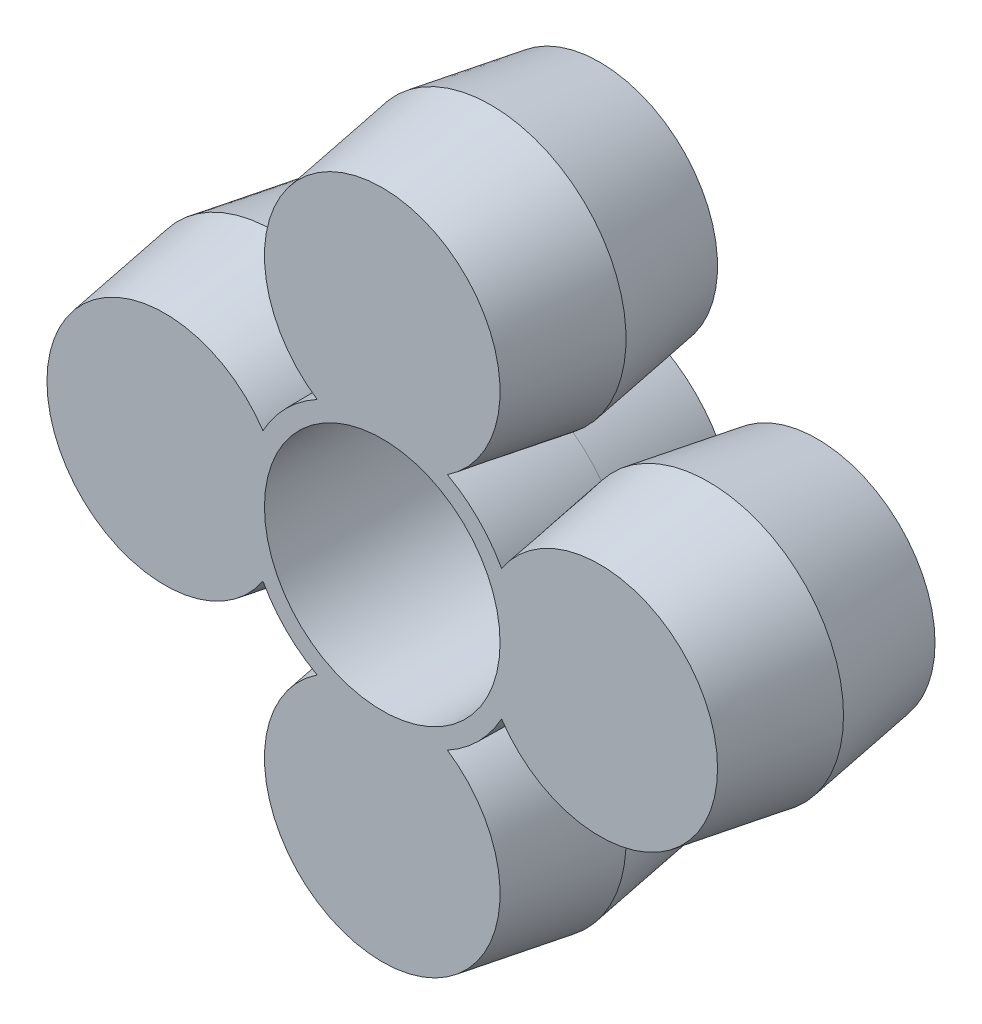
ISO-10303-21;
HEADER;
FILE_DESCRIPTION(('STEP AP214'),'2;1');
FILE_NAME('part.step','',(''),(''),'','','');
FILE_SCHEMA(('AUTOMOTIVE_DESIGN { 1 0 10303 214 1 1 1 1 }'));
ENDSEC;
DATA;
#1=APPLICATION_CONTEXT('core data for automotive mechanical design processes');
#2=APPLICATION_PROTOCOL_DEFINITION('international standard','automotive_design',2000,#1);
#3=PRODUCT_CONTEXT('',#1,'mechanical');
#4=PRODUCT('Part','Part','',(#3));
#5=PRODUCT_RELATED_PRODUCT_CATEGORY('part','',(#4));
#6=PRODUCT_DEFINITION_FORMATION('','',#4);
#7=PRODUCT_DEFINITION_CONTEXT('part definition',#1,'design');
#8=PRODUCT_DEFINITION('design','',#6,#7);
#9=PRODUCT_DEFINITION_SHAPE('','',#8);
#10=(LENGTH_UNIT() NAMED_UNIT(*) SI_UNIT(.MILLI.,.METRE.));
#11=(NAMED_UNIT(*) PLANE_ANGLE_UNIT() SI_UNIT($,.RADIAN.));
#12=(NAMED_UNIT(*) SI_UNIT($,.STERADIAN.) SOLID_ANGLE_UNIT());
#13=UNCERTAINTY_MEASURE_WITH_UNIT(LENGTH_MEASURE(1.E-05),#10,'distance_accuracy_value','');
#14=(GEOMETRIC_REPRESENTATION_CONTEXT(3) GLOBAL_UNCERTAINTY_ASSIGNED_CONTEXT((#13)) GLOBAL_UNIT_ASSIGNED_CONTEXT((#10,
#11,#12)) REPRESENTATION_CONTEXT('',''));
#15=CARTESIAN_POINT('',(0.,0.,0.));
#16=DIRECTION('',(0.,0.,1.));
#17=DIRECTION('',(1.,0.,0.));
#18=AXIS2_PLACEMENT_3D('',#15,#16,#17);
#19=CARTESIAN_POINT('',(0.,0.,-12.));
#20=DIRECTION('',(0.,0.,1.));
#21=DIRECTION('',(1.,0.,0.));
#22=AXIS2_PLACEMENT_3D('',#19,#20,#21);
#23=CONICAL_SURFACE('',#22,7.5,0.0130899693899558);
#24=CARTESIAN_POINT('',(0.,0.,-12.));
#25=DIRECTION('',(0.,0.,1.));
#26=DIRECTION('',(1.,0.,0.));
#27=AXIS2_PLACEMENT_3D('',#24,#25,#26);
#28=CIRCLE('',#27,7.5);
#29=CARTESIAN_POINT('',(3.59301018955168,6.58333333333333,-12.));
#30=VERTEX_POINT('',#29);
#31=CARTESIAN_POINT('',(6.58333333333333,3.59301018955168,-12.));
#32=VERTEX_POINT('',#31);
#33=EDGE_CURVE('E117',#30,#32,#28,.F.);
#34=ORIENTED_EDGE('',*,*,#33,.F.);
#35=CARTESIAN_POINT('',(3.59301018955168,6.58333333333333,-12.));
#36=CARTESIAN_POINT('',(3.62831831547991,6.56716735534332,-11.7917016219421));
#37=CARTESIAN_POINT('',(3.66326227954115,6.55086224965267,-11.5833522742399));
#38=CARTESIAN_POINT('',(3.79749136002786,6.48706692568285,-10.7748716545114));
#39=CARTESIAN_POINT('',(3.89426254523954,6.43856369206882,-10.1744012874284));
#40=CARTESIAN_POINT('',(4.06586710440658,6.34828377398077,-9.08205060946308));
#41=CARTESIAN_POINT('',(4.14149186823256,6.3068860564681,-8.59026246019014));
#42=CARTESIAN_POINT('',(4.28196818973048,6.22705349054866,-7.65884142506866));
#43=CARTESIAN_POINT('',(4.34710864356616,6.18877340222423,-7.21923883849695));
#44=CARTESIAN_POINT('',(4.44907497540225,6.12690243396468,-6.51972483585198));
#45=CARTESIAN_POINT('',(4.48658191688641,6.10370908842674,-6.25987733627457));
#46=CARTESIAN_POINT('',(4.52374323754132,6.08030269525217,-5.99999999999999));
#47=B_SPLINE_CURVE_WITH_KNOTS('',3,(#35,#36,#37,#38,#39,#40,#41,#42,#43,#44,#45,#46),
.UNSPECIFIED.,.F.,.F.,(4,2,2,2,2,4),(0.,0.635661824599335,2.46607723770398,3.96393102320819,
5.30206851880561,6.09275574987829),.UNSPECIFIED.);
#48=CARTESIAN_POINT('',(4.52374323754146,6.0803026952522,-6.));
#49=VERTEX_POINT('',#48);
#50=EDGE_CURVE('E122',#30,#49,#47,.T.);
#51=ORIENTED_EDGE('',*,*,#50,.T.);
#52=CARTESIAN_POINT('',(0.,0.,-6.));
#53=DIRECTION('',(0.,0.,1.));
#54=DIRECTION('',(1.,0.,0.));
#55=AXIS2_PLACEMENT_3D('',#52,#53,#54);
#56=CIRCLE('',#55,7.578544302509);
#57=CARTESIAN_POINT('',(6.0803026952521,4.52374323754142,-6.));
#58=VERTEX_POINT('',#57);
#59=EDGE_CURVE('E119',#49,#58,#56,.F.);
#60=ORIENTED_EDGE('',*,*,#59,.T.);
#61=CARTESIAN_POINT('',(6.58333333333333,3.59301018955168,-12.));
#62=CARTESIAN_POINT('',(6.5691052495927,3.62408777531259,-11.8166715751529));
#63=CARTESIAN_POINT('',(6.55476938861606,3.65488108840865,-11.6333033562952));
#64=CARTESIAN_POINT('',(6.51303889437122,3.74307048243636,-11.1034058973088));
#65=CARTESIAN_POINT('',(6.48536773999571,3.79977349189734,-10.756782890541));
#66=CARTESIAN_POINT('',(6.42925570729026,3.91145625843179,-10.0632787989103));
#67=CARTESIAN_POINT('',(6.40081473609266,3.96643580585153,-9.7163976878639));
#68=CARTESIAN_POINT('',(6.33675865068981,4.08687172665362,-8.94530159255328));
#69=CARTESIAN_POINT('',(6.30095451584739,4.15193935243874,-8.52104164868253));
#70=CARTESIAN_POINT('',(6.20469878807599,4.32128764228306,-7.39805222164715));
#71=CARTESIAN_POINT('',(6.14327156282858,4.4237358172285,-6.6991290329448));
#72=CARTESIAN_POINT('',(6.08030269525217,4.52374323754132,-5.99999999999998));
#73=B_SPLINE_CURVE_WITH_KNOTS('',3,(#61,#62,#63,#64,#65,#66,#67,#68,#69,#70,#71,#72),
.UNSPECIFIED.,.F.,.F.,(4,2,2,2,2,4),(0.,0.559462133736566,1.61641188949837,2.67348972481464,
3.96561693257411,6.09275638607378),.UNSPECIFIED.);
#74=EDGE_CURVE('E20',#32,#58,#73,.T.);
#75=ORIENTED_EDGE('',*,*,#74,.F.);
#76=EDGE_LOOP('',(#34,#51,#60,#75));
#77=FACE_BOUND('',#76,.T.);
#78=ADVANCED_FACE('F16',(#77),#23,.T.);
#79=CARTESIAN_POINT('',(0.,12.,-12.));
#80=DIRECTION('',(0.,0.,1.));
#81=DIRECTION('',(1.,0.,0.));
#82=AXIS2_PLACEMENT_3D('',#79,#80,#81);
#83=CONICAL_SURFACE('',#82,6.5,0.157079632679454);
#84=CARTESIAN_POINT('',(0.,12.,-12.));
#85=DIRECTION('',(0.,0.,1.));
#86=DIRECTION('',(1.,0.,0.));
#87=AXIS2_PLACEMENT_3D('',#84,#85,#86);
#88=CIRCLE('',#87,6.5);
#89=CARTESIAN_POINT('',(-3.59301018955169,6.58333333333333,-12.));
#90=VERTEX_POINT('',#89);
#91=EDGE_CURVE('E135',#90,#30,#88,.F.);
#92=ORIENTED_EDGE('',*,*,#91,.F.);
#93=CARTESIAN_POINT('',(-3.59301018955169,6.58333333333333,-12.));
#94=CARTESIAN_POINT('',(-3.6240877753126,6.56910524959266,-11.8166715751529));
#95=CARTESIAN_POINT('',(-3.65488108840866,6.554769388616,-11.6333033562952));
#96=CARTESIAN_POINT('',(-3.74307048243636,6.51303889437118,-11.1034058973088));
#97=CARTESIAN_POINT('',(-3.79977349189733,6.48536773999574,-10.756782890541));
#98=CARTESIAN_POINT('',(-3.91145625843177,6.42925570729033,-10.0632787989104));
#99=CARTESIAN_POINT('',(-3.96643580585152,6.40081473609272,-9.71639768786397));
#100=CARTESIAN_POINT('',(-4.08687172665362,6.33675865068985,-8.9453015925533));
#101=CARTESIAN_POINT('',(-4.15193935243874,6.30095451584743,-8.5210416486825));
#102=CARTESIAN_POINT('',(-4.32128764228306,6.20469878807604,-7.39805222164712));
#103=CARTESIAN_POINT('',(-4.4237358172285,6.14327156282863,-6.69912903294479));
#104=CARTESIAN_POINT('',(-4.52374323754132,6.08030269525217,-6.00000000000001));
#105=B_SPLINE_CURVE_WITH_KNOTS('',3,(#93,#94,#95,#96,#97,#98,#99,#100,#101,#102,#103,#104),
.UNSPECIFIED.,.F.,.F.,(4,2,2,2,2,4),(0.,0.559462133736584,1.61641188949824,2.67348972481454,
3.96561693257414,6.09275638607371),.UNSPECIFIED.);
#106=CARTESIAN_POINT('',(-4.52374323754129,6.08030269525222,-6.));
#107=VERTEX_POINT('',#106);
#108=EDGE_CURVE('E211',#90,#107,#105,.T.);
#109=ORIENTED_EDGE('',*,*,#108,.T.);
#110=CARTESIAN_POINT('',(0.,12.,-6.));
#111=DIRECTION('',(0.,0.,1.));
#112=DIRECTION('',(0.,1.,0.));
#113=AXIS2_PLACEMENT_3D('',#110,#111,#112);
#114=CIRCLE('',#113,7.450306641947);
#115=EDGE_CURVE('E339',#107,#49,#114,.F.);
#116=ORIENTED_EDGE('',*,*,#115,.T.);
#117=ORIENTED_EDGE('',*,*,#50,.F.);
#118=EDGE_LOOP('',(#92,#109,#116,#117));
#119=FACE_BOUND('',#118,.T.);
#120=ADVANCED_FACE('F207',(#119),#83,.T.);
#121=CARTESIAN_POINT('',(0.,0.,-12.));
#122=DIRECTION('',(0.,0.,1.));
#123=DIRECTION('',(1.,0.,0.));
#124=AXIS2_PLACEMENT_3D('',#121,#122,#123);
#125=CONICAL_SURFACE('',#124,7.5,0.0130899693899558);
#126=CARTESIAN_POINT('',(0.,0.,-12.));
#127=DIRECTION('',(0.,0.,1.));
#128=DIRECTION('',(1.,0.,0.));
#129=AXIS2_PLACEMENT_3D('',#126,#127,#128);
#130=CIRCLE('',#129,7.5);
#131=CARTESIAN_POINT('',(-6.58333333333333,3.59301018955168,-12.));
#132=VERTEX_POINT('',#131);
#133=EDGE_CURVE('E137',#132,#90,#130,.F.);
#134=ORIENTED_EDGE('',*,*,#133,.F.);
#135=CARTESIAN_POINT('',(-6.58333333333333,3.59301018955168,-12.));
#136=CARTESIAN_POINT('',(-6.56716735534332,3.62831831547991,-11.7917016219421));
#137=CARTESIAN_POINT('',(-6.55086224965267,3.66326227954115,-11.5833522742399));
#138=CARTESIAN_POINT('',(-6.48706692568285,3.79749136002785,-10.7748716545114));
#139=CARTESIAN_POINT('',(-6.43856369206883,3.89426254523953,-10.1744012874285));
#140=CARTESIAN_POINT('',(-6.34828377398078,4.06586710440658,-9.08205060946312));
#141=CARTESIAN_POINT('',(-6.3068860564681,4.14149186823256,-8.59026246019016));
#142=CARTESIAN_POINT('',(-6.22705349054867,4.28196818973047,-7.6588414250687));
#143=CARTESIAN_POINT('',(-6.18877340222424,4.34710864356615,-7.21923883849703));
#144=CARTESIAN_POINT('',(-6.12690243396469,4.44907497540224,-6.51972483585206));
#145=CARTESIAN_POINT('',(-6.10370908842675,4.4865819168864,-6.25987733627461));
#146=CARTESIAN_POINT('',(-6.08030269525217,4.52374323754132,-5.99999999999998));
#147=B_SPLINE_CURVE_WITH_KNOTS('',3,(#135,#136,#137,#138,#139,#140,#141,#142,#143,#144,#145,
#146),.UNSPECIFIED.,.F.,.F.,(4,2,2,2,2,4),(0.,0.635661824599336,2.46607723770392,
3.9639310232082,5.30206851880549,6.0927557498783),.UNSPECIFIED.);
#148=CARTESIAN_POINT('',(-6.08030269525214,4.52374323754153,-6.));
#149=VERTEX_POINT('',#148);
#150=EDGE_CURVE('E192',#132,#149,#147,.T.);
#151=ORIENTED_EDGE('',*,*,#150,.T.);
#152=CARTESIAN_POINT('',(0.,0.,-6.));
#153=DIRECTION('',(0.,0.,1.));
#154=DIRECTION('',(1.,0.,0.));
#155=AXIS2_PLACEMENT_3D('',#152,#153,#154);
#156=CIRCLE('',#155,7.578544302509);
#157=EDGE_CURVE('E334',#149,#107,#156,.F.);
#158=ORIENTED_EDGE('',*,*,#157,.T.);
#159=ORIENTED_EDGE('',*,*,#108,.F.);
#160=EDGE_LOOP('',(#134,#151,#158,#159));
#161=FACE_BOUND('',#160,.T.);
#162=ADVANCED_FACE('F201',(#161),#125,.T.);
#163=CARTESIAN_POINT('',(-12.,0.,-12.));
#164=DIRECTION('',(0.,0.,1.));
#165=DIRECTION('',(1.,0.,0.));
#166=AXIS2_PLACEMENT_3D('',#163,#164,#165);
#167=CONICAL_SURFACE('',#166,6.5,0.157079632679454);
#168=CARTESIAN_POINT('',(-12.,0.,-12.));
#169=DIRECTION('',(0.,0.,1.));
#170=DIRECTION('',(1.,0.,0.));
#171=AXIS2_PLACEMENT_3D('',#168,#169,#170);
#172=CIRCLE('',#171,6.5);
#173=CARTESIAN_POINT('',(-6.58333333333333,-3.59301018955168,-12.));
#174=VERTEX_POINT('',#173);
#175=EDGE_CURVE('E142',#174,#132,#172,.F.);
#176=ORIENTED_EDGE('',*,*,#175,.F.);
#177=CARTESIAN_POINT('',(-6.58333333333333,-3.59301018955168,-12.));
#178=CARTESIAN_POINT('',(-6.56910524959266,-3.62408777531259,-11.8166715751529));
#179=CARTESIAN_POINT('',(-6.554769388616,-3.65488108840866,-11.6333033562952));
#180=CARTESIAN_POINT('',(-6.51303889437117,-3.74307048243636,-11.1034058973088));
#181=CARTESIAN_POINT('',(-6.48536773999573,-3.79977349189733,-10.756782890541));
#182=CARTESIAN_POINT('',(-6.42925570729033,-3.91145625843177,-10.0632787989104));
#183=CARTESIAN_POINT('',(-6.40081473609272,-3.96643580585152,-9.71639768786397));
#184=CARTESIAN_POINT('',(-6.33675865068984,-4.08687172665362,-8.94530159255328));
#185=CARTESIAN_POINT('',(-6.30095451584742,-4.15193935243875,-8.52104164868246));
#186=CARTESIAN_POINT('',(-6.20469878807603,-4.32128764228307,-7.39805222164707));
#187=CARTESIAN_POINT('',(-6.14327156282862,-4.4237358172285,-6.69912903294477));
#188=CARTESIAN_POINT('',(-6.08030269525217,-4.52374323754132,-6.00000000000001));
#189=B_SPLINE_CURVE_WITH_KNOTS('',3,(#177,#178,#179,#180,#181,#182,#183,#184,#185,#186,#187,
#188),.UNSPECIFIED.,.F.,.F.,(4,2,2,2,2,4),(0.,0.559462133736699,1.61641188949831,
2.67348972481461,3.96561693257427,6.09275638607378),.UNSPECIFIED.);
#190=CARTESIAN_POINT('',(-6.08030269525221,-4.5237432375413,-6.));
#191=VERTEX_POINT('',#190);
#192=EDGE_CURVE('E186',#174,#191,#189,.T.);
#193=ORIENTED_EDGE('',*,*,#192,.T.);
#194=CARTESIAN_POINT('',(-12.,0.,-6.));
#195=DIRECTION('',(0.,0.,1.));
#196=DIRECTION('',(-1.,0.,0.));
#197=AXIS2_PLACEMENT_3D('',#194,#195,#196);
#198=CIRCLE('',#197,7.450306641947);
#199=EDGE_CURVE('E452',#191,#149,#198,.F.);
#200=ORIENTED_EDGE('',*,*,#199,.T.);
#201=ORIENTED_EDGE('',*,*,#150,.F.);
#202=EDGE_LOOP('',(#176,#193,#200,#201));
#203=FACE_BOUND('',#202,.T.);
#204=ADVANCED_FACE('F198',(#203),#167,.T.);
#205=CARTESIAN_POINT('',(0.,0.,-12.));
#206=DIRECTION('',(0.,0.,1.));
#207=DIRECTION('',(1.,0.,0.));
#208=AXIS2_PLACEMENT_3D('',#205,#206,#207);
#209=CONICAL_SURFACE('',#208,7.5,0.0130899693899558);
#210=CARTESIAN_POINT('',(0.,0.,-12.));
#211=DIRECTION('',(0.,0.,1.));
#212=DIRECTION('',(1.,0.,0.));
#213=AXIS2_PLACEMENT_3D('',#210,#211,#212);
#214=CIRCLE('',#213,7.5);
#215=CARTESIAN_POINT('',(-3.59301018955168,-6.58333333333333,-12.));
#216=VERTEX_POINT('',#215);
#217=EDGE_CURVE('E145',#216,#174,#214,.F.);
#218=ORIENTED_EDGE('',*,*,#217,.F.);
#219=CARTESIAN_POINT('',(-3.59301018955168,-6.58333333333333,-12.));
#220=CARTESIAN_POINT('',(-3.62831831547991,-6.56716735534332,-11.791701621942));
#221=CARTESIAN_POINT('',(-3.66326227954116,-6.55086224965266,-11.5833522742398));
#222=CARTESIAN_POINT('',(-3.79749136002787,-6.48706692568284,-10.7748716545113));
#223=CARTESIAN_POINT('',(-3.89426254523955,-6.43856369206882,-10.1744012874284));
#224=CARTESIAN_POINT('',(-4.06586710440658,-6.34828377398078,-9.08205060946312));
#225=CARTESIAN_POINT('',(-4.14149186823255,-6.30688605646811,-8.59026246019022));
#226=CARTESIAN_POINT('',(-4.28196818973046,-6.22705349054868,-7.65884142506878));
#227=CARTESIAN_POINT('',(-4.34710864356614,-6.18877340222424,-7.21923883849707));
#228=CARTESIAN_POINT('',(-4.44907497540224,-6.12690243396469,-6.51972483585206));
#229=CARTESIAN_POINT('',(-4.4865819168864,-6.10370908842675,-6.25987733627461));
#230=CARTESIAN_POINT('',(-4.52374323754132,-6.08030269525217,-5.99999999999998));
#231=B_SPLINE_CURVE_WITH_KNOTS('',3,(#219,#220,#221,#222,#223,#224,#225,#226,#227,#228,#229,
#230),.UNSPECIFIED.,.F.,.F.,(4,2,2,2,2,4),(0.,0.635661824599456,2.46607723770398,
3.96393102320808,5.30206851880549,6.0927557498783),.UNSPECIFIED.);
#232=CARTESIAN_POINT('',(-4.52374323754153,-6.08030269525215,-6.));
#233=VERTEX_POINT('',#232);
#234=EDGE_CURVE('E180',#216,#233,#231,.T.);
#235=ORIENTED_EDGE('',*,*,#234,.T.);
#236=CARTESIAN_POINT('',(0.,0.,-6.));
#237=DIRECTION('',(0.,0.,1.));
#238=DIRECTION('',(1.,0.,0.));
#239=AXIS2_PLACEMENT_3D('',#236,#237,#238);
#240=CIRCLE('',#239,7.578544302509);
#241=EDGE_CURVE('E308',#233,#191,#240,.F.);
#242=ORIENTED_EDGE('',*,*,#241,.T.);
#243=ORIENTED_EDGE('',*,*,#192,.F.);
#244=EDGE_LOOP('',(#218,#235,#242,#243));
#245=FACE_BOUND('',#244,.T.);
#246=ADVANCED_FACE('F175',(#245),#209,.T.);
#247=CARTESIAN_POINT('',(0.,-12.,-12.));
#248=DIRECTION('',(0.,0.,1.));
#249=DIRECTION('',(1.,0.,0.));
#250=AXIS2_PLACEMENT_3D('',#247,#248,#249);
#251=CONICAL_SURFACE('',#250,6.5,0.157079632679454);
#252=CARTESIAN_POINT('',(0.,-12.,-12.));
#253=DIRECTION('',(0.,0.,1.));
#254=DIRECTION('',(1.,0.,0.));
#255=AXIS2_PLACEMENT_3D('',#252,#253,#254);
#256=CIRCLE('',#255,6.5);
#257=CARTESIAN_POINT('',(3.59301018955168,-6.58333333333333,-12.));
#258=VERTEX_POINT('',#257);
#259=EDGE_CURVE('E148',#258,#216,#256,.F.);
#260=ORIENTED_EDGE('',*,*,#259,.F.);
#261=CARTESIAN_POINT('',(3.59301018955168,-6.58333333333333,-12.));
#262=CARTESIAN_POINT('',(3.62408777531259,-6.56910524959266,-11.8166715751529));
#263=CARTESIAN_POINT('',(3.65488108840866,-6.55476938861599,-11.6333033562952));
#264=CARTESIAN_POINT('',(3.74307048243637,-6.51303889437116,-11.1034058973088));
#265=CARTESIAN_POINT('',(3.79977349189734,-6.48536773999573,-10.756782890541));
#266=CARTESIAN_POINT('',(3.91145625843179,-6.42925570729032,-10.0632787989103));
#267=CARTESIAN_POINT('',(3.96643580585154,-6.40081473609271,-9.71639768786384));
#268=CARTESIAN_POINT('',(4.08687172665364,-6.33675865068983,-8.94530159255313));
#269=CARTESIAN_POINT('',(4.15193935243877,-6.30095451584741,-8.52104164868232));
#270=CARTESIAN_POINT('',(4.32128764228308,-6.20469878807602,-7.39805222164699));
#271=CARTESIAN_POINT('',(4.42373581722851,-6.14327156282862,-6.69912903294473));
#272=CARTESIAN_POINT('',(4.52374323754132,-6.08030269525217,-6.));
#273=B_SPLINE_CURVE_WITH_KNOTS('',3,(#261,#262,#263,#264,#265,#266,#267,#268,#269,#270,#271,
#272),.UNSPECIFIED.,.F.,.F.,(4,2,2,2,2,4),(0.,0.5594621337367,1.61641188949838,2.67348972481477,
3.96561693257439,6.09275638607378),.UNSPECIFIED.);
#274=CARTESIAN_POINT('',(4.52374323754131,-6.08030269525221,-6.));
#275=VERTEX_POINT('',#274);
#276=EDGE_CURVE('E158',#258,#275,#273,.T.);
#277=ORIENTED_EDGE('',*,*,#276,.T.);
#278=CARTESIAN_POINT('',(0.,-12.,-6.));
#279=DIRECTION('',(0.,0.,1.));
#280=DIRECTION('',(0.,-1.,0.));
#281=AXIS2_PLACEMENT_3D('',#278,#279,#280);
#282=CIRCLE('',#281,7.450306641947);
#283=EDGE_CURVE('E301',#275,#233,#282,.F.);
#284=ORIENTED_EDGE('',*,*,#283,.T.);
#285=ORIENTED_EDGE('',*,*,#234,.F.);
#286=EDGE_LOOP('',(#260,#277,#284,#285));
#287=FACE_BOUND('',#286,.T.);
#288=ADVANCED_FACE('F169',(#287),#251,.T.);
#289=CARTESIAN_POINT('',(0.,0.,-12.));
#290=DIRECTION('',(0.,0.,1.));
#291=DIRECTION('',(1.,0.,0.));
#292=AXIS2_PLACEMENT_3D('',#289,#290,#291);
#293=CONICAL_SURFACE('',#292,7.5,0.0130899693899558);
#294=CARTESIAN_POINT('',(0.,0.,-12.));
#295=DIRECTION('',(0.,0.,1.));
#296=DIRECTION('',(1.,0.,0.));
#297=AXIS2_PLACEMENT_3D('',#294,#295,#296);
#298=CIRCLE('',#297,7.5);
#299=CARTESIAN_POINT('',(6.58333333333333,-3.59301018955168,-12.));
#300=VERTEX_POINT('',#299);
#301=EDGE_CURVE('E151',#300,#258,#298,.F.);
#302=ORIENTED_EDGE('',*,*,#301,.F.);
#303=CARTESIAN_POINT('',(6.58333333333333,-3.59301018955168,-12.));
#304=CARTESIAN_POINT('',(6.56716735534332,-3.62831831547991,-11.7917016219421));
#305=CARTESIAN_POINT('',(6.55086224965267,-3.66326227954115,-11.5833522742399));
#306=CARTESIAN_POINT('',(6.48706692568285,-3.79749136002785,-10.7748716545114));
#307=CARTESIAN_POINT('',(6.43856369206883,-3.89426254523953,-10.1744012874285));
#308=CARTESIAN_POINT('',(6.34828377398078,-4.06586710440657,-9.08205060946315));
#309=CARTESIAN_POINT('',(6.30688605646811,-4.14149186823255,-8.59026246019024));
#310=CARTESIAN_POINT('',(6.22705349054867,-4.28196818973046,-7.65884142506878));
#311=CARTESIAN_POINT('',(6.18877340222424,-4.34710864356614,-7.21923883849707));
#312=CARTESIAN_POINT('',(6.12690243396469,-4.44907497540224,-6.51972483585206));
#313=CARTESIAN_POINT('',(6.10370908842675,-4.4865819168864,-6.25987733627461));
#314=CARTESIAN_POINT('',(6.08030269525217,-4.52374323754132,-5.99999999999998));
#315=B_SPLINE_CURVE_WITH_KNOTS('',3,(#303,#304,#305,#306,#307,#308,#309,#310,#311,#312,#313,
#314),.UNSPECIFIED.,.F.,.F.,(4,2,2,2,2,4),(0.,0.635661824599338,2.46607723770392,
3.96393102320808,5.30206851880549,6.0927557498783),.UNSPECIFIED.);
#316=CARTESIAN_POINT('',(6.08030269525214,-4.52374323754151,-6.));
#317=VERTEX_POINT('',#316);
#318=EDGE_CURVE('E127',#300,#317,#315,.T.);
#319=ORIENTED_EDGE('',*,*,#318,.T.);
#320=CARTESIAN_POINT('',(0.,0.,-6.));
#321=DIRECTION('',(0.,0.,1.));
#322=DIRECTION('',(1.,0.,0.));
#323=AXIS2_PLACEMENT_3D('',#320,#321,#322);
#324=CIRCLE('',#323,7.578544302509);
#325=EDGE_CURVE('E438',#317,#275,#324,.F.);
#326=ORIENTED_EDGE('',*,*,#325,.T.);
#327=ORIENTED_EDGE('',*,*,#276,.F.);
#328=EDGE_LOOP('',(#302,#319,#326,#327));
#329=FACE_BOUND('',#328,.T.);
#330=ADVANCED_FACE('F166',(#329),#293,.T.);
#331=CARTESIAN_POINT('',(12.,0.,-12.));
#332=DIRECTION('',(0.,0.,1.));
#333=DIRECTION('',(1.,0.,0.));
#334=AXIS2_PLACEMENT_3D('',#331,#332,#333);
#335=CONICAL_SURFACE('',#334,6.5,0.157079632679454);
#336=CARTESIAN_POINT('',(12.,0.,-6.));
#337=DIRECTION('',(0.,0.,1.));
#338=DIRECTION('',(1.,0.,0.));
#339=AXIS2_PLACEMENT_3D('',#336,#337,#338);
#340=CIRCLE('',#339,7.450306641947);
#341=EDGE_CURVE('E275',#58,#317,#340,.F.);
#342=ORIENTED_EDGE('',*,*,#341,.T.);
#343=ORIENTED_EDGE('',*,*,#318,.F.);
#344=CARTESIAN_POINT('',(12.,0.,-12.));
#345=DIRECTION('',(0.,0.,1.));
#346=DIRECTION('',(1.,0.,0.));
#347=AXIS2_PLACEMENT_3D('',#344,#345,#346);
#348=CIRCLE('',#347,6.5);
#349=EDGE_CURVE('E124',#32,#300,#348,.F.);
#350=ORIENTED_EDGE('',*,*,#349,.F.);
#351=ORIENTED_EDGE('',*,*,#74,.T.);
#352=EDGE_LOOP('',(#342,#343,#350,#351));
#353=FACE_BOUND('',#352,.T.);
#354=ADVANCED_FACE('F125',(#353),#335,.T.);
#355=CARTESIAN_POINT('',(-21.5580611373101,21.5580611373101,-12.));
#356=DIRECTION('',(0.,0.,-1.));
#357=DIRECTION('',(1.,0.,0.));
#358=AXIS2_PLACEMENT_3D('',#355,#356,#357);
#359=PLANE('',#358);
#360=CARTESIAN_POINT('',(0.,0.,-12.));
#361=DIRECTION('',(0.,0.,1.));
#362=DIRECTION('',(1.,0.,0.));
#363=AXIS2_PLACEMENT_3D('',#360,#361,#362);
#364=CIRCLE('',#363,6.5);
#365=CARTESIAN_POINT('',(6.5,0.,-12.));
#366=VERTEX_POINT('',#365);
#367=EDGE_CURVE('E263',#366,#366,#364,.F.);
#368=ORIENTED_EDGE('',*,*,#367,.F.);
#369=EDGE_LOOP('',(#368));
#370=FACE_BOUND('',#369,.T.);
#371=ORIENTED_EDGE('',*,*,#33,.T.);
#372=ORIENTED_EDGE('',*,*,#349,.T.);
#373=ORIENTED_EDGE('',*,*,#301,.T.);
#374=ORIENTED_EDGE('',*,*,#259,.T.);
#375=ORIENTED_EDGE('',*,*,#217,.T.);
#376=ORIENTED_EDGE('',*,*,#175,.T.);
#377=ORIENTED_EDGE('',*,*,#133,.T.);
#378=ORIENTED_EDGE('',*,*,#91,.T.);
#379=EDGE_LOOP('',(#371,#372,#373,#374,#375,#376,#377,#378));
#380=FACE_BOUND('',#379,.T.);
#381=ADVANCED_FACE('F132',(#370,#380),#359,.T.);
#382=CARTESIAN_POINT('',(0.,0.,-6.));
#383=DIRECTION('',(0.,0.,-1.));
#384=DIRECTION('',(-1.,0.,0.));
#385=AXIS2_PLACEMENT_3D('',#382,#383,#384);
#386=CONICAL_SURFACE('',#385,7.578544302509,0.0130899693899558);
#387=CARTESIAN_POINT('',(6.08030269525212,4.52374323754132,-6.00000000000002));
#388=CARTESIAN_POINT('',(6.14327155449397,4.4237358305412,-5.30087106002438));
#389=CARTESIAN_POINT('',(6.20469877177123,4.32128766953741,-4.60194796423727));
#390=CARTESIAN_POINT('',(6.30095449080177,4.15193939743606,-3.4789586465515));
#391=CARTESIAN_POINT('',(6.33675862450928,4.08687177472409,-3.05469871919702));
#392=CARTESIAN_POINT('',(6.40081470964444,3.96643585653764,-2.28360263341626));
#393=CARTESIAN_POINT('',(6.42925568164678,3.91145630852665,-1.93672151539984));
#394=CARTESIAN_POINT('',(6.48536770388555,3.79977356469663,-1.24321755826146));
#395=CARTESIAN_POINT('',(6.5130388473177,3.74307057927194,-0.896594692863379));
#396=CARTESIAN_POINT('',(6.55476935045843,3.65488117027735,-0.366697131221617));
#397=CARTESIAN_POINT('',(6.5691052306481,3.6240878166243,-0.183328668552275));
#398=CARTESIAN_POINT('',(6.58333333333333,3.59301018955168,0.));
#399=B_SPLINE_CURVE_WITH_KNOTS('',3,(#387,#388,#389,#390,#391,#392,#393,#394,#395,#396,#397,
#398),.UNSPECIFIED.,.F.,.F.,(4,2,2,2,2,4),(0.,2.12713917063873,3.41926632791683,
4.47634418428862,5.5332935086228,6.0927563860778),.UNSPECIFIED.);
#400=CARTESIAN_POINT('',(6.58333333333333,3.59301018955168,0.));
#401=VERTEX_POINT('',#400);
#402=EDGE_CURVE('E107',#58,#401,#399,.T.);
#403=ORIENTED_EDGE('',*,*,#402,.F.);
#404=ORIENTED_EDGE('',*,*,#59,.F.);
#405=CARTESIAN_POINT('',(4.52374323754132,6.08030269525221,-6.00000000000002));
#406=CARTESIAN_POINT('',(4.48658191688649,6.10370908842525,-5.74012266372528));
#407=CARTESIAN_POINT('',(4.4490749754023,6.12690243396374,-5.48027516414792));
#408=CARTESIAN_POINT('',(4.34710864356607,6.18877340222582,-4.78076116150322));
#409=CARTESIAN_POINT('',(4.28196818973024,6.22705349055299,-4.34115857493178));
#410=CARTESIAN_POINT('',(4.14149186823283,6.30688605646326,-3.40973753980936));
#411=CARTESIAN_POINT('',(4.06586710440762,6.34828377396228,-2.91794939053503));
#412=CARTESIAN_POINT('',(3.89426255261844,6.43856368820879,-1.82559875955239));
#413=CARTESIAN_POINT('',(3.79749137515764,6.48706691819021,-1.22512843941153));
#414=CARTESIAN_POINT('',(3.66326229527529,6.55086224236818,-0.416647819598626));
#415=CARTESIAN_POINT('',(3.62831832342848,6.56716735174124,-0.208298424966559));
#416=CARTESIAN_POINT('',(3.59301018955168,6.58333333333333,0.));
#417=B_SPLINE_CURVE_WITH_KNOTS('',3,(#405,#406,#407,#408,#409,#410,#411,#412,#413,#414,#415,
#416),.UNSPECIFIED.,.F.,.F.,(4,2,2,2,2,4),(0.,0.790687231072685,2.1288247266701,
3.62667851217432,5.45709378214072,6.09275574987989),.UNSPECIFIED.);
#418=CARTESIAN_POINT('',(3.59301018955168,6.58333333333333,0.));
#419=VERTEX_POINT('',#418);
#420=EDGE_CURVE('E335',#49,#419,#417,.T.);
#421=ORIENTED_EDGE('',*,*,#420,.T.);
#422=CARTESIAN_POINT('',(0.,0.,0.));
#423=DIRECTION('',(0.,0.,-1.));
#424=DIRECTION('',(-1.,0.,0.));
#425=AXIS2_PLACEMENT_3D('',#422,#423,#424);
#426=CIRCLE('',#425,7.5);
#427=EDGE_CURVE('E260',#401,#419,#426,.F.);
#428=ORIENTED_EDGE('',*,*,#427,.F.);
#429=EDGE_LOOP('',(#403,#404,#421,#428));
#430=FACE_BOUND('',#429,.T.);
#431=ADVANCED_FACE('F343',(#430),#386,.T.);
#432=CARTESIAN_POINT('',(0.,12.,-6.));
#433=DIRECTION('',(0.,0.,-1.));
#434=DIRECTION('',(-1.,0.,0.));
#435=AXIS2_PLACEMENT_3D('',#432,#433,#434);
#436=CONICAL_SURFACE('',#435,7.450306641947,0.157079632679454);
#437=CARTESIAN_POINT('',(-4.52374323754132,6.0803026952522,-5.99999999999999));
#438=CARTESIAN_POINT('',(-4.42373583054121,6.14327155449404,-5.3008710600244));
#439=CARTESIAN_POINT('',(-4.32128766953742,6.20469877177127,-4.60194796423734));
#440=CARTESIAN_POINT('',(-4.15193939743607,6.30095449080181,-3.47895864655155));
#441=CARTESIAN_POINT('',(-4.08687177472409,6.33675862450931,-3.05469871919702));
#442=CARTESIAN_POINT('',(-3.96643585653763,6.4008147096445,-2.28360263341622));
#443=CARTESIAN_POINT('',(-3.91145630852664,6.42925568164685,-1.93672151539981));
#444=CARTESIAN_POINT('',(-3.79977356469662,6.48536770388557,-1.24321755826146));
#445=CARTESIAN_POINT('',(-3.74307057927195,6.51303884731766,-0.896594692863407));
#446=CARTESIAN_POINT('',(-3.65488117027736,6.55476935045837,-0.366697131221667));
#447=CARTESIAN_POINT('',(-3.62408781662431,6.56910523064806,-0.183328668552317));
#448=CARTESIAN_POINT('',(-3.59301018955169,6.58333333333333,0.));
#449=B_SPLINE_CURVE_WITH_KNOTS('',3,(#437,#438,#439,#440,#441,#442,#443,#444,#445,#446,#447,
#448),.UNSPECIFIED.,.F.,.F.,(4,2,2,2,2,4),(0.,2.12713917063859,3.41926632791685,
4.47634418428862,5.5332935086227,6.09275638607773),.UNSPECIFIED.);
#450=CARTESIAN_POINT('',(-3.59301018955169,6.58333333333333,0.));
#451=VERTEX_POINT('',#450);
#452=EDGE_CURVE('E328',#107,#451,#449,.T.);
#453=ORIENTED_EDGE('',*,*,#452,.T.);
#454=CARTESIAN_POINT('',(0.,12.,0.));
#455=DIRECTION('',(0.,0.,-1.));
#456=DIRECTION('',(-1.,0.,0.));
#457=AXIS2_PLACEMENT_3D('',#454,#455,#456);
#458=CIRCLE('',#457,6.5);
#459=EDGE_CURVE('E258',#419,#451,#458,.F.);
#460=ORIENTED_EDGE('',*,*,#459,.F.);
#461=ORIENTED_EDGE('',*,*,#420,.F.);
#462=ORIENTED_EDGE('',*,*,#115,.F.);
#463=EDGE_LOOP('',(#453,#460,#461,#462));
#464=FACE_BOUND('',#463,.T.);
#465=ADVANCED_FACE('F324',(#464),#436,.T.);
#466=CARTESIAN_POINT('',(0.,0.,-6.));
#467=DIRECTION('',(0.,0.,-1.));
#468=DIRECTION('',(-1.,0.,0.));
#469=AXIS2_PLACEMENT_3D('',#466,#467,#468);
#470=CONICAL_SURFACE('',#469,7.578544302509,0.0130899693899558);
#471=ORIENTED_EDGE('',*,*,#452,.F.);
#472=ORIENTED_EDGE('',*,*,#157,.F.);
#473=CARTESIAN_POINT('',(-6.08030269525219,4.52374323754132,-6.00000000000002));
#474=CARTESIAN_POINT('',(-6.10370908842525,4.48658191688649,-5.74012266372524));
#475=CARTESIAN_POINT('',(-6.12690243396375,4.44907497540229,-5.48027516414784));
#476=CARTESIAN_POINT('',(-6.18877340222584,4.34710864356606,-4.78076116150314));
#477=CARTESIAN_POINT('',(-6.22705349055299,4.28196818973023,-4.34115857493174));
#478=CARTESIAN_POINT('',(-6.30688605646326,4.14149186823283,-3.40973753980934));
#479=CARTESIAN_POINT('',(-6.34828377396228,4.06586710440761,-2.91794939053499));
#480=CARTESIAN_POINT('',(-6.43856368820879,3.89426255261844,-1.82559875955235));
#481=CARTESIAN_POINT('',(-6.48706691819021,3.79749137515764,-1.22512843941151));
#482=CARTESIAN_POINT('',(-6.55086224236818,3.66326229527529,-0.416647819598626));
#483=CARTESIAN_POINT('',(-6.56716735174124,3.62831832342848,-0.208298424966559));
#484=CARTESIAN_POINT('',(-6.58333333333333,3.59301018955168,0.));
#485=B_SPLINE_CURVE_WITH_KNOTS('',3,(#473,#474,#475,#476,#477,#478,#479,#480,#481,#482,#483,
#484),.UNSPECIFIED.,.F.,.F.,(4,2,2,2,2,4),(0.,0.79068723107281,2.1288247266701,3.62667851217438,
5.45709378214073,6.0927557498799),.UNSPECIFIED.);
#486=CARTESIAN_POINT('',(-6.58333333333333,3.59301018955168,0.));
#487=VERTEX_POINT('',#486);
#488=EDGE_CURVE('E309',#149,#487,#485,.T.);
#489=ORIENTED_EDGE('',*,*,#488,.T.);
#490=CARTESIAN_POINT('',(0.,0.,0.));
#491=DIRECTION('',(0.,0.,-1.));
#492=DIRECTION('',(-1.,0.,0.));
#493=AXIS2_PLACEMENT_3D('',#490,#491,#492);
#494=CIRCLE('',#493,7.5);
#495=EDGE_CURVE('E255',#451,#487,#494,.F.);
#496=ORIENTED_EDGE('',*,*,#495,.F.);
#497=EDGE_LOOP('',(#471,#472,#489,#496));
#498=FACE_BOUND('',#497,.T.);
#499=ADVANCED_FACE('F318',(#498),#470,.T.);
#500=CARTESIAN_POINT('',(-12.,0.,-6.));
#501=DIRECTION('',(0.,0.,-1.));
#502=DIRECTION('',(-1.,0.,0.));
#503=AXIS2_PLACEMENT_3D('',#500,#501,#502);
#504=CONICAL_SURFACE('',#503,7.450306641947,0.157079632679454);
#505=CARTESIAN_POINT('',(-6.08030269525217,-4.52374323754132,-5.99999999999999));
#506=CARTESIAN_POINT('',(-6.14327155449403,-4.42373583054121,-5.30087106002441));
#507=CARTESIAN_POINT('',(-6.20469877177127,-4.32128766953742,-4.60194796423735));
#508=CARTESIAN_POINT('',(-6.3009544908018,-4.15193939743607,-3.47895864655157));
#509=CARTESIAN_POINT('',(-6.33675862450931,-4.08687177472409,-3.05469871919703));
#510=CARTESIAN_POINT('',(-6.40081470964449,-3.96643585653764,-2.28360263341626));
#511=CARTESIAN_POINT('',(-6.42925568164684,-3.91145630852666,-1.93672151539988));
#512=CARTESIAN_POINT('',(-6.48536770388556,-3.79977356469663,-1.24321755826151));
#513=CARTESIAN_POINT('',(-6.51303884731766,-3.74307057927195,-0.896594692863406));
#514=CARTESIAN_POINT('',(-6.55476935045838,-3.65488117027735,-0.366697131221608));
#515=CARTESIAN_POINT('',(-6.56910523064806,-3.6240878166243,-0.183328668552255));
#516=CARTESIAN_POINT('',(-6.58333333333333,-3.59301018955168,0.));
#517=B_SPLINE_CURVE_WITH_KNOTS('',3,(#505,#506,#507,#508,#509,#510,#511,#512,#513,#514,#515,
#516),.UNSPECIFIED.,.F.,.F.,(4,2,2,2,2,4),(0.,2.12713917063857,3.41926632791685,
4.47634418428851,5.53329350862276,6.0927563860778),.UNSPECIFIED.);
#518=CARTESIAN_POINT('',(-6.58333333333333,-3.59301018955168,0.));
#519=VERTEX_POINT('',#518);
#520=EDGE_CURVE('E302',#191,#519,#517,.T.);
#521=ORIENTED_EDGE('',*,*,#520,.T.);
#522=CARTESIAN_POINT('',(-12.,0.,0.));
#523=DIRECTION('',(0.,0.,-1.));
#524=DIRECTION('',(-1.,0.,0.));
#525=AXIS2_PLACEMENT_3D('',#522,#523,#524);
#526=CIRCLE('',#525,6.5);
#527=EDGE_CURVE('E253',#487,#519,#526,.F.);
#528=ORIENTED_EDGE('',*,*,#527,.F.);
#529=ORIENTED_EDGE('',*,*,#488,.F.);
#530=ORIENTED_EDGE('',*,*,#199,.F.);
#531=EDGE_LOOP('',(#521,#528,#529,#530));
#532=FACE_BOUND('',#531,.T.);
#533=ADVANCED_FACE('F315',(#532),#504,.T.);
#534=CARTESIAN_POINT('',(0.,0.,-6.));
#535=DIRECTION('',(0.,0.,-1.));
#536=DIRECTION('',(-1.,0.,0.));
#537=AXIS2_PLACEMENT_3D('',#534,#535,#536);
#538=CONICAL_SURFACE('',#537,7.578544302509,0.0130899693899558);
#539=ORIENTED_EDGE('',*,*,#520,.F.);
#540=ORIENTED_EDGE('',*,*,#241,.F.);
#541=CARTESIAN_POINT('',(-4.52374323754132,-6.08030269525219,-6.00000000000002));
#542=CARTESIAN_POINT('',(-4.48658191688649,-6.10370908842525,-5.74012266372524));
#543=CARTESIAN_POINT('',(-4.44907497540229,-6.12690243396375,-5.48027516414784));
#544=CARTESIAN_POINT('',(-4.34710864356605,-6.18877340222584,-4.7807611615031));
#545=CARTESIAN_POINT('',(-4.28196818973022,-6.227053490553,-4.34115857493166));
#546=CARTESIAN_POINT('',(-4.14149186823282,-6.30688605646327,-3.40973753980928));
#547=CARTESIAN_POINT('',(-4.06586710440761,-6.34828377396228,-2.91794939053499));
#548=CARTESIAN_POINT('',(-3.89426255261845,-6.43856368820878,-1.82559875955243));
#549=CARTESIAN_POINT('',(-3.79749137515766,-6.4870669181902,-1.22512843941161));
#550=CARTESIAN_POINT('',(-3.6632622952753,-6.55086224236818,-0.416647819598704));
#551=CARTESIAN_POINT('',(-3.62831832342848,-6.56716735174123,-0.208298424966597));
#552=CARTESIAN_POINT('',(-3.59301018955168,-6.58333333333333,0.));
#553=B_SPLINE_CURVE_WITH_KNOTS('',3,(#541,#542,#543,#544,#545,#546,#547,#548,#549,#550,#551,
#552),.UNSPECIFIED.,.F.,.F.,(4,2,2,2,2,4),(0.,0.79068723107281,2.12882472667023,
3.62667851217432,5.45709378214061,6.0927557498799),.UNSPECIFIED.);
#554=CARTESIAN_POINT('',(-3.59301018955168,-6.58333333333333,0.));
#555=VERTEX_POINT('',#554);
#556=EDGE_CURVE('E296',#233,#555,#553,.T.);
#557=ORIENTED_EDGE('',*,*,#556,.T.);
#558=CARTESIAN_POINT('',(0.,0.,0.));
#559=DIRECTION('',(0.,0.,-1.));
#560=DIRECTION('',(-1.,0.,0.));
#561=AXIS2_PLACEMENT_3D('',#558,#559,#560);
#562=CIRCLE('',#561,7.5);
#563=EDGE_CURVE('E247',#519,#555,#562,.F.);
#564=ORIENTED_EDGE('',*,*,#563,.F.);
#565=EDGE_LOOP('',(#539,#540,#557,#564));
#566=FACE_BOUND('',#565,.T.);
#567=ADVANCED_FACE('F291',(#566),#538,.T.);
#568=CARTESIAN_POINT('',(0.,-12.,-6.));
#569=DIRECTION('',(0.,0.,-1.));
#570=DIRECTION('',(-1.,0.,0.));
#571=AXIS2_PLACEMENT_3D('',#568,#569,#570);
#572=CONICAL_SURFACE('',#571,7.450306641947,0.157079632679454);
#573=CARTESIAN_POINT('',(4.52374323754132,-6.08030269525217,-5.99999999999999));
#574=CARTESIAN_POINT('',(4.42373583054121,-6.14327155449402,-5.30087106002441));
#575=CARTESIAN_POINT('',(4.32128766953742,-6.20469877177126,-4.60194796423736));
#576=CARTESIAN_POINT('',(4.15193939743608,-6.3009544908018,-3.47895864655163));
#577=CARTESIAN_POINT('',(4.08687177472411,-6.3367586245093,-3.05469871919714));
#578=CARTESIAN_POINT('',(3.96643585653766,-6.40081470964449,-2.28360263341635));
#579=CARTESIAN_POINT('',(3.91145630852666,-6.42925568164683,-1.93672151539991));
#580=CARTESIAN_POINT('',(3.79977356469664,-6.48536770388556,-1.24321755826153));
#581=CARTESIAN_POINT('',(3.74307057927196,-6.51303884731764,-0.896594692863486));
#582=CARTESIAN_POINT('',(3.65488117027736,-6.55476935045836,-0.366697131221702));
#583=CARTESIAN_POINT('',(3.62408781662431,-6.56910523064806,-0.183328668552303));
#584=CARTESIAN_POINT('',(3.59301018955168,-6.58333333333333,0.));
#585=B_SPLINE_CURVE_WITH_KNOTS('',3,(#573,#574,#575,#576,#577,#578,#579,#580,#581,#582,#583,
#584),.UNSPECIFIED.,.F.,.F.,(4,2,2,2,2,4),(0.,2.12713917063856,3.41926632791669,
4.47634418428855,5.53329350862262,6.0927563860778),.UNSPECIFIED.);
#586=CARTESIAN_POINT('',(3.59301018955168,-6.58333333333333,0.));
#587=VERTEX_POINT('',#586);
#588=EDGE_CURVE('E276',#275,#587,#585,.T.);
#589=ORIENTED_EDGE('',*,*,#588,.T.);
#590=CARTESIAN_POINT('',(0.,-12.,0.));
#591=DIRECTION('',(0.,0.,-1.));
#592=DIRECTION('',(-1.,0.,0.));
#593=AXIS2_PLACEMENT_3D('',#590,#591,#592);
#594=CIRCLE('',#593,6.5);
#595=EDGE_CURVE('E243',#555,#587,#594,.F.);
#596=ORIENTED_EDGE('',*,*,#595,.F.);
#597=ORIENTED_EDGE('',*,*,#556,.F.);
#598=ORIENTED_EDGE('',*,*,#283,.F.);
#599=EDGE_LOOP('',(#589,#596,#597,#598));
#600=FACE_BOUND('',#599,.T.);
#601=ADVANCED_FACE('F286',(#600),#572,.T.);
#602=CARTESIAN_POINT('',(0.,0.,-6.));
#603=DIRECTION('',(0.,0.,-1.));
#604=DIRECTION('',(-1.,0.,0.));
#605=AXIS2_PLACEMENT_3D('',#602,#603,#604);
#606=CONICAL_SURFACE('',#605,7.578544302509,0.0130899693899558);
#607=ORIENTED_EDGE('',*,*,#588,.F.);
#608=ORIENTED_EDGE('',*,*,#325,.F.);
#609=CARTESIAN_POINT('',(6.08030269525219,-4.52374323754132,-6.00000000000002));
#610=CARTESIAN_POINT('',(6.10370908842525,-4.48658191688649,-5.74012266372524));
#611=CARTESIAN_POINT('',(6.12690243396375,-4.44907497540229,-5.48027516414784));
#612=CARTESIAN_POINT('',(6.18877340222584,-4.34710864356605,-4.7807611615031));
#613=CARTESIAN_POINT('',(6.227053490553,-4.28196818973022,-4.34115857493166));
#614=CARTESIAN_POINT('',(6.30688605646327,-4.14149186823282,-3.40973753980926));
#615=CARTESIAN_POINT('',(6.34828377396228,-4.06586710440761,-2.91794939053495));
#616=CARTESIAN_POINT('',(6.43856368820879,-3.89426255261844,-1.82559875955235));
#617=CARTESIAN_POINT('',(6.48706691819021,-3.79749137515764,-1.22512843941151));
#618=CARTESIAN_POINT('',(6.55086224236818,-3.66326229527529,-0.416647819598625));
#619=CARTESIAN_POINT('',(6.56716735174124,-3.62831832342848,-0.208298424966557));
#620=CARTESIAN_POINT('',(6.58333333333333,-3.59301018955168,0.));
#621=B_SPLINE_CURVE_WITH_KNOTS('',3,(#609,#610,#611,#612,#613,#614,#615,#616,#617,#618,#619,
#620),.UNSPECIFIED.,.F.,.F.,(4,2,2,2,2,4),(0.,0.79068723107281,2.12882472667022,
3.62667851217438,5.45709378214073,6.0927557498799),.UNSPECIFIED.);
#622=CARTESIAN_POINT('',(6.58333333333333,-3.59301018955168,0.));
#623=VERTEX_POINT('',#622);
#624=EDGE_CURVE('E266',#317,#623,#621,.T.);
#625=ORIENTED_EDGE('',*,*,#624,.T.);
#626=CARTESIAN_POINT('',(0.,0.,0.));
#627=DIRECTION('',(0.,0.,-1.));
#628=DIRECTION('',(-1.,0.,0.));
#629=AXIS2_PLACEMENT_3D('',#626,#627,#628);
#630=CIRCLE('',#629,7.5);
#631=EDGE_CURVE('E31',#587,#623,#630,.F.);
#632=ORIENTED_EDGE('',*,*,#631,.F.);
#633=EDGE_LOOP('',(#607,#608,#625,#632));
#634=FACE_BOUND('',#633,.T.);
#635=ADVANCED_FACE('F283',(#634),#606,.T.);
#636=CARTESIAN_POINT('',(12.,0.,-6.));
#637=DIRECTION('',(0.,0.,-1.));
#638=DIRECTION('',(-1.,0.,0.));
#639=AXIS2_PLACEMENT_3D('',#636,#637,#638);
#640=CONICAL_SURFACE('',#639,7.450306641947,0.157079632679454);
#641=ORIENTED_EDGE('',*,*,#624,.F.);
#642=ORIENTED_EDGE('',*,*,#341,.F.);
#643=ORIENTED_EDGE('',*,*,#402,.T.);
#644=CARTESIAN_POINT('',(12.,0.,0.));
#645=DIRECTION('',(0.,0.,-1.));
#646=DIRECTION('',(-1.,0.,0.));
#647=AXIS2_PLACEMENT_3D('',#644,#645,#646);
#648=CIRCLE('',#647,6.5);
#649=EDGE_CURVE('E40',#623,#401,#648,.F.);
#650=ORIENTED_EDGE('',*,*,#649,.F.);
#651=EDGE_LOOP('',(#641,#642,#643,#650));
#652=FACE_BOUND('',#651,.T.);
#653=ADVANCED_FACE('F233',(#652),#640,.T.);
#654=CARTESIAN_POINT('',(0.,0.,-12.));
#655=DIRECTION('',(0.,0.,1.));
#656=DIRECTION('',(1.,0.,0.));
#657=AXIS2_PLACEMENT_3D('',#654,#655,#656);
#658=CYLINDRICAL_SURFACE('',#657,6.5);
#659=ORIENTED_EDGE('',*,*,#367,.T.);
#660=EDGE_LOOP('',(#659));
#661=FACE_BOUND('',#660,.T.);
#662=CARTESIAN_POINT('',(0.,0.,0.));
#663=DIRECTION('',(0.,0.,1.));
#664=DIRECTION('',(1.,0.,0.));
#665=AXIS2_PLACEMENT_3D('',#662,#663,#664);
#666=CIRCLE('',#665,6.5);
#667=CARTESIAN_POINT('',(6.5,0.,0.));
#668=VERTEX_POINT('',#667);
#669=EDGE_CURVE('E11',#668,#668,#666,.F.);
#670=ORIENTED_EDGE('',*,*,#669,.F.);
#671=EDGE_LOOP('',(#670));
#672=FACE_BOUND('',#671,.T.);
#673=ADVANCED_FACE('F228',(#661,#672),#658,.F.);
#674=CARTESIAN_POINT('',(-21.5580611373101,-21.5580611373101,0.));
#675=DIRECTION('',(0.,0.,1.));
#676=DIRECTION('',(1.,0.,0.));
#677=AXIS2_PLACEMENT_3D('',#674,#675,#676);
#678=PLANE('',#677);
#679=ORIENTED_EDGE('',*,*,#669,.T.);
#680=EDGE_LOOP('',(#679));
#681=FACE_BOUND('',#680,.T.);
#682=ORIENTED_EDGE('',*,*,#631,.T.);
#683=ORIENTED_EDGE('',*,*,#649,.T.);
#684=ORIENTED_EDGE('',*,*,#427,.T.);
#685=ORIENTED_EDGE('',*,*,#459,.T.);
#686=ORIENTED_EDGE('',*,*,#495,.T.);
#687=ORIENTED_EDGE('',*,*,#527,.T.);
#688=ORIENTED_EDGE('',*,*,#563,.T.);
#689=ORIENTED_EDGE('',*,*,#595,.T.);
#690=EDGE_LOOP('',(#682,#683,#684,#685,#686,#687,#688,#689));
#691=FACE_BOUND('',#690,.T.);
#692=ADVANCED_FACE('F18',(#681,#691),#678,.T.);
#693=CLOSED_SHELL('',(#78,#120,#162,#204,#246,#288,#330,#354,#381,#431,#465,#499,#533,#567,#601,
#635,#653,#673,#692));
#694=MANIFOLD_SOLID_BREP('B1',#693);
#695=ADVANCED_BREP_SHAPE_REPRESENTATION('',(#18,#694),#14);
#696=SHAPE_DEFINITION_REPRESENTATION(#9,#695);
ENDSEC;
END-ISO-10303-21;
